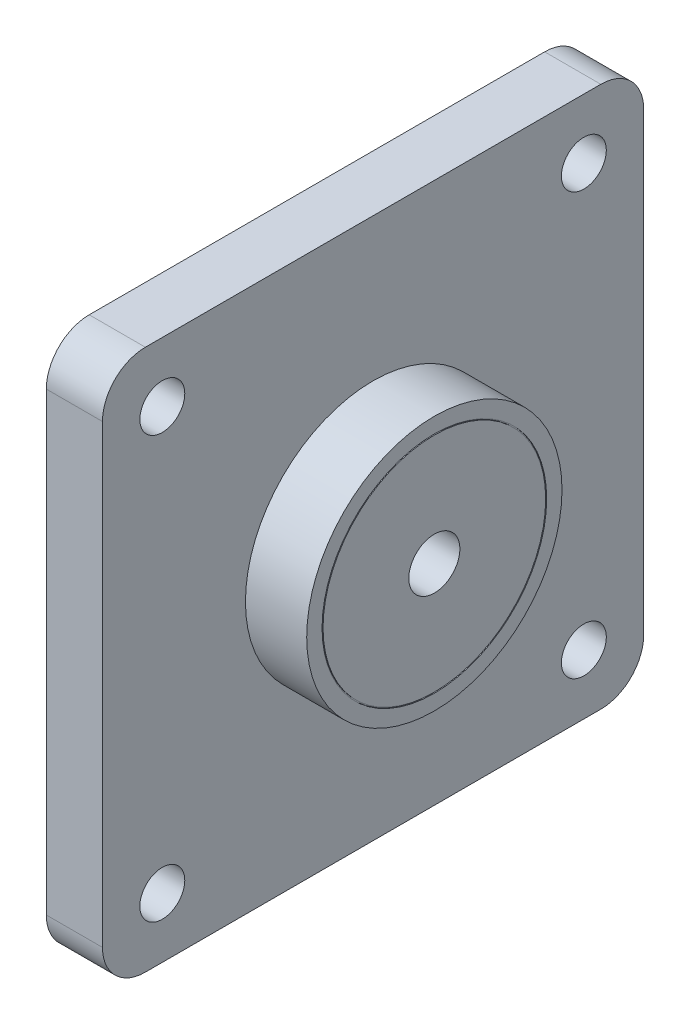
ISO-10303-21;
HEADER;
FILE_DESCRIPTION(('STEP AP214'),'2;1');
FILE_NAME('part.step','',(''),(''),'','','');
FILE_SCHEMA(('AUTOMOTIVE_DESIGN { 1 0 10303 214 1 1 1 1 }'));
ENDSEC;
DATA;
#1=APPLICATION_CONTEXT('core data for automotive mechanical design processes');
#2=APPLICATION_PROTOCOL_DEFINITION('international standard','automotive_design',2000,#1);
#3=PRODUCT_CONTEXT('',#1,'mechanical');
#4=PRODUCT('Part','Part','',(#3));
#5=PRODUCT_RELATED_PRODUCT_CATEGORY('part','',(#4));
#6=PRODUCT_DEFINITION_FORMATION('','',#4);
#7=PRODUCT_DEFINITION_CONTEXT('part definition',#1,'design');
#8=PRODUCT_DEFINITION('design','',#6,#7);
#9=PRODUCT_DEFINITION_SHAPE('','',#8);
#10=(LENGTH_UNIT() NAMED_UNIT(*) SI_UNIT(.MILLI.,.METRE.));
#11=(NAMED_UNIT(*) PLANE_ANGLE_UNIT() SI_UNIT($,.RADIAN.));
#12=(NAMED_UNIT(*) SI_UNIT($,.STERADIAN.) SOLID_ANGLE_UNIT());
#13=UNCERTAINTY_MEASURE_WITH_UNIT(LENGTH_MEASURE(1.E-05),#10,'distance_accuracy_value','');
#14=(GEOMETRIC_REPRESENTATION_CONTEXT(3) GLOBAL_UNCERTAINTY_ASSIGNED_CONTEXT((#13)) GLOBAL_UNIT_ASSIGNED_CONTEXT((#10,
#11,#12)) REPRESENTATION_CONTEXT('',''));
#15=CARTESIAN_POINT('',(0.,0.,0.));
#16=DIRECTION('',(0.,0.,1.));
#17=DIRECTION('',(1.,0.,0.));
#18=AXIS2_PLACEMENT_3D('',#15,#16,#17);
#19=CARTESIAN_POINT('',(0.,-33.655,33.655));
#20=DIRECTION('',(1.,0.,0.));
#21=DIRECTION('',(0.,0.,-1.));
#22=AXIS2_PLACEMENT_3D('',#19,#20,#21);
#23=PLANE('',#22);
#24=CARTESIAN_POINT('',(0.,26.2128,26.2128));
#25=DIRECTION('',(1.,0.,0.));
#26=DIRECTION('',(0.,0.,-1.));
#27=AXIS2_PLACEMENT_3D('',#24,#25,#26);
#28=CIRCLE('',#27,2.79400000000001);
#29=CARTESIAN_POINT('',(0.,26.2128,23.4188));
#30=VERTEX_POINT('',#29);
#31=EDGE_CURVE('E190',#30,#30,#28,.T.);
#32=ORIENTED_EDGE('',*,*,#31,.T.);
#33=EDGE_LOOP('',(#32));
#34=FACE_BOUND('',#33,.T.);
#35=CARTESIAN_POINT('',(0.,26.2128,-26.2128));
#36=DIRECTION('',(1.,0.,0.));
#37=DIRECTION('',(0.,0.,-1.));
#38=AXIS2_PLACEMENT_3D('',#35,#36,#37);
#39=CIRCLE('',#38,2.79400000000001);
#40=CARTESIAN_POINT('',(0.,26.2128,-29.0068));
#41=VERTEX_POINT('',#40);
#42=EDGE_CURVE('E184',#41,#41,#39,.T.);
#43=ORIENTED_EDGE('',*,*,#42,.T.);
#44=EDGE_LOOP('',(#43));
#45=FACE_BOUND('',#44,.T.);
#46=CARTESIAN_POINT('',(0.,-26.2128,-26.2128));
#47=DIRECTION('',(1.,0.,0.));
#48=DIRECTION('',(0.,0.,-1.));
#49=AXIS2_PLACEMENT_3D('',#46,#47,#48);
#50=CIRCLE('',#49,2.79400000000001);
#51=CARTESIAN_POINT('',(0.,-26.2128,-29.0068));
#52=VERTEX_POINT('',#51);
#53=EDGE_CURVE('E178',#52,#52,#50,.T.);
#54=ORIENTED_EDGE('',*,*,#53,.T.);
#55=EDGE_LOOP('',(#54));
#56=FACE_BOUND('',#55,.T.);
#57=CARTESIAN_POINT('',(0.,-26.2128,26.2128));
#58=DIRECTION('',(1.,0.,0.));
#59=DIRECTION('',(0.,0.,-1.));
#60=AXIS2_PLACEMENT_3D('',#57,#58,#59);
#61=CIRCLE('',#60,2.79400000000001);
#62=CARTESIAN_POINT('',(0.,-26.2128,23.4188));
#63=VERTEX_POINT('',#62);
#64=EDGE_CURVE('E172',#63,#63,#61,.T.);
#65=ORIENTED_EDGE('',*,*,#64,.T.);
#66=EDGE_LOOP('',(#65));
#67=FACE_BOUND('',#66,.T.);
#68=DIRECTION('',(0.,0.,1.));
#69=VECTOR('',#68,1.);
#70=CARTESIAN_POINT('',(0.,33.655,-33.655));
#71=LINE('',#70,#69);
#72=CARTESIAN_POINT('',(0.,33.655,-28.321));
#73=VERTEX_POINT('',#72);
#74=CARTESIAN_POINT('',(0.,33.655,28.321));
#75=VERTEX_POINT('',#74);
#76=EDGE_CURVE('E100',#73,#75,#71,.T.);
#77=ORIENTED_EDGE('',*,*,#76,.F.);
#78=CARTESIAN_POINT('',(0.,28.321,-28.321));
#79=DIRECTION('',(1.,0.,0.));
#80=DIRECTION('',(0.,0.,-1.));
#81=AXIS2_PLACEMENT_3D('',#78,#79,#80);
#82=CIRCLE('',#81,5.334);
#83=CARTESIAN_POINT('',(0.,28.321,-33.655));
#84=VERTEX_POINT('',#83);
#85=EDGE_CURVE('E83',#73,#84,#82,.F.);
#86=ORIENTED_EDGE('',*,*,#85,.T.);
#87=DIRECTION('',(0.,1.,0.));
#88=VECTOR('',#87,1.);
#89=CARTESIAN_POINT('',(0.,-33.655,-33.655));
#90=LINE('',#89,#88);
#91=CARTESIAN_POINT('',(0.,-28.321,-33.655));
#92=VERTEX_POINT('',#91);
#93=EDGE_CURVE('E110',#92,#84,#90,.T.);
#94=ORIENTED_EDGE('',*,*,#93,.F.);
#95=CARTESIAN_POINT('',(0.,-28.321,-28.321));
#96=DIRECTION('',(1.,0.,0.));
#97=DIRECTION('',(0.,0.,-1.));
#98=AXIS2_PLACEMENT_3D('',#95,#96,#97);
#99=CIRCLE('',#98,5.334);
#100=CARTESIAN_POINT('',(0.,-33.655,-28.321));
#101=VERTEX_POINT('',#100);
#102=EDGE_CURVE('E94',#92,#101,#99,.F.);
#103=ORIENTED_EDGE('',*,*,#102,.T.);
#104=DIRECTION('',(0.,0.,-1.));
#105=VECTOR('',#104,1.);
#106=CARTESIAN_POINT('',(0.,-33.655,33.655));
#107=LINE('',#106,#105);
#108=CARTESIAN_POINT('',(0.,-33.655,28.321));
#109=VERTEX_POINT('',#108);
#110=EDGE_CURVE('E114',#109,#101,#107,.T.);
#111=ORIENTED_EDGE('',*,*,#110,.F.);
#112=CARTESIAN_POINT('',(0.,-28.321,28.321));
#113=DIRECTION('',(1.,0.,0.));
#114=DIRECTION('',(0.,0.,-1.));
#115=AXIS2_PLACEMENT_3D('',#112,#113,#114);
#116=CIRCLE('',#115,5.334);
#117=CARTESIAN_POINT('',(0.,-28.321,33.655));
#118=VERTEX_POINT('',#117);
#119=EDGE_CURVE('E120',#109,#118,#116,.F.);
#120=ORIENTED_EDGE('',*,*,#119,.T.);
#121=DIRECTION('',(0.,-1.,0.));
#122=VECTOR('',#121,1.);
#123=CARTESIAN_POINT('',(0.,33.655,33.655));
#124=LINE('',#123,#122);
#125=CARTESIAN_POINT('',(0.,28.321,33.655));
#126=VERTEX_POINT('',#125);
#127=EDGE_CURVE('E142',#126,#118,#124,.T.);
#128=ORIENTED_EDGE('',*,*,#127,.F.);
#129=CARTESIAN_POINT('',(0.,28.321,28.321));
#130=DIRECTION('',(1.,0.,0.));
#131=DIRECTION('',(0.,0.,-1.));
#132=AXIS2_PLACEMENT_3D('',#129,#130,#131);
#133=CIRCLE('',#132,5.334);
#134=EDGE_CURVE('E104',#126,#75,#133,.F.);
#135=ORIENTED_EDGE('',*,*,#134,.T.);
#136=EDGE_LOOP('',(#77,#86,#94,#103,#111,#120,#128,#135));
#137=FACE_BOUND('',#136,.T.);
#138=CARTESIAN_POINT('',(0.,0.,0.));
#139=DIRECTION('',(1.,0.,0.));
#140=DIRECTION('',(0.,0.,-1.));
#141=AXIS2_PLACEMENT_3D('',#138,#139,#140);
#142=CIRCLE('',#141,3.175);
#143=CARTESIAN_POINT('',(0.,0.,-3.175));
#144=VERTEX_POINT('',#143);
#145=EDGE_CURVE('E197',#144,#144,#142,.T.);
#146=ORIENTED_EDGE('',*,*,#145,.T.);
#147=EDGE_LOOP('',(#146));
#148=FACE_BOUND('',#147,.T.);
#149=ADVANCED_FACE('F17',(#34,#45,#56,#67,#137,#148),#23,.F.);
#150=CARTESIAN_POINT('',(14.605,0.,0.));
#151=DIRECTION('',(1.,0.,0.));
#152=DIRECTION('',(0.,0.,-1.));
#153=AXIS2_PLACEMENT_3D('',#150,#151,#152);
#154=PLANE('',#153);
#155=CARTESIAN_POINT('',(14.605,0.,0.));
#156=DIRECTION('',(-1.,0.,0.));
#157=DIRECTION('',(0.,0.,1.));
#158=AXIS2_PLACEMENT_3D('',#155,#156,#157);
#159=CIRCLE('',#158,13.843);
#160=CARTESIAN_POINT('',(14.605,0.,13.843));
#161=VERTEX_POINT('',#160);
#162=EDGE_CURVE('E163',#161,#161,#159,.T.);
#163=ORIENTED_EDGE('',*,*,#162,.F.);
#164=EDGE_LOOP('',(#163));
#165=FACE_BOUND('',#164,.T.);
#166=CARTESIAN_POINT('',(14.605,0.,0.));
#167=DIRECTION('',(1.,0.,0.));
#168=DIRECTION('',(0.,0.,-1.));
#169=AXIS2_PLACEMENT_3D('',#166,#167,#168);
#170=CIRCLE('',#169,3.175);
#171=CARTESIAN_POINT('',(14.605,0.,-3.175));
#172=VERTEX_POINT('',#171);
#173=EDGE_CURVE('E196',#172,#172,#170,.T.);
#174=ORIENTED_EDGE('',*,*,#173,.F.);
#175=EDGE_LOOP('',(#174));
#176=FACE_BOUND('',#175,.T.);
#177=ADVANCED_FACE('F206',(#165,#176),#154,.T.);
#178=CARTESIAN_POINT('',(14.605,0.,0.));
#179=DIRECTION('',(1.,0.,0.));
#180=DIRECTION('',(0.,0.,-1.));
#181=AXIS2_PLACEMENT_3D('',#178,#179,#180);
#182=CIRCLE('',#181,15.875);
#183=CARTESIAN_POINT('',(14.605,0.,15.875));
#184=VERTEX_POINT('',#183);
#185=EDGE_CURVE('E147',#184,#184,#182,.T.);
#186=ORIENTED_EDGE('',*,*,#185,.T.);
#187=EDGE_LOOP('',(#186));
#188=FACE_BOUND('',#187,.T.);
#189=CARTESIAN_POINT('',(14.605,0.,0.));
#190=DIRECTION('',(-1.,0.,0.));
#191=DIRECTION('',(0.,0.,1.));
#192=AXIS2_PLACEMENT_3D('',#189,#190,#191);
#193=CIRCLE('',#192,13.97);
#194=CARTESIAN_POINT('',(14.605,0.,13.97));
#195=VERTEX_POINT('',#194);
#196=EDGE_CURVE('E166',#195,#195,#193,.T.);
#197=ORIENTED_EDGE('',*,*,#196,.T.);
#198=EDGE_LOOP('',(#197));
#199=FACE_BOUND('',#198,.T.);
#200=ADVANCED_FACE('F208',(#188,#199),#154,.T.);
#201=CARTESIAN_POINT('',(6.985,-33.655,33.655));
#202=DIRECTION('',(1.,0.,0.));
#203=DIRECTION('',(0.,0.,-1.));
#204=AXIS2_PLACEMENT_3D('',#201,#202,#203);
#205=PLANE('',#204);
#206=CARTESIAN_POINT('',(6.985,26.2128,26.2128));
#207=DIRECTION('',(1.,0.,0.));
#208=DIRECTION('',(0.,0.,-1.));
#209=AXIS2_PLACEMENT_3D('',#206,#207,#208);
#210=CIRCLE('',#209,2.79400000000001);
#211=CARTESIAN_POINT('',(6.985,26.2128,23.4188));
#212=VERTEX_POINT('',#211);
#213=EDGE_CURVE('E193',#212,#212,#210,.T.);
#214=ORIENTED_EDGE('',*,*,#213,.F.);
#215=EDGE_LOOP('',(#214));
#216=FACE_BOUND('',#215,.T.);
#217=CARTESIAN_POINT('',(6.985,26.2128,-26.2128));
#218=DIRECTION('',(1.,0.,0.));
#219=DIRECTION('',(0.,0.,-1.));
#220=AXIS2_PLACEMENT_3D('',#217,#218,#219);
#221=CIRCLE('',#220,2.79400000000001);
#222=CARTESIAN_POINT('',(6.985,26.2128,-29.0068));
#223=VERTEX_POINT('',#222);
#224=EDGE_CURVE('E187',#223,#223,#221,.T.);
#225=ORIENTED_EDGE('',*,*,#224,.F.);
#226=EDGE_LOOP('',(#225));
#227=FACE_BOUND('',#226,.T.);
#228=CARTESIAN_POINT('',(6.985,-26.2128,-26.2128));
#229=DIRECTION('',(1.,0.,0.));
#230=DIRECTION('',(0.,0.,-1.));
#231=AXIS2_PLACEMENT_3D('',#228,#229,#230);
#232=CIRCLE('',#231,2.79400000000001);
#233=CARTESIAN_POINT('',(6.985,-26.2128,-29.0068));
#234=VERTEX_POINT('',#233);
#235=EDGE_CURVE('E181',#234,#234,#232,.T.);
#236=ORIENTED_EDGE('',*,*,#235,.F.);
#237=EDGE_LOOP('',(#236));
#238=FACE_BOUND('',#237,.T.);
#239=CARTESIAN_POINT('',(6.985,-26.2128,26.2128));
#240=DIRECTION('',(1.,0.,0.));
#241=DIRECTION('',(0.,0.,-1.));
#242=AXIS2_PLACEMENT_3D('',#239,#240,#241);
#243=CIRCLE('',#242,2.79400000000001);
#244=CARTESIAN_POINT('',(6.985,-26.2128,23.4188));
#245=VERTEX_POINT('',#244);
#246=EDGE_CURVE('E175',#245,#245,#243,.T.);
#247=ORIENTED_EDGE('',*,*,#246,.F.);
#248=EDGE_LOOP('',(#247));
#249=FACE_BOUND('',#248,.T.);
#250=DIRECTION('',(0.,1.,0.));
#251=VECTOR('',#250,1.);
#252=CARTESIAN_POINT('',(6.985,-33.655,-33.655));
#253=LINE('',#252,#251);
#254=CARTESIAN_POINT('',(6.985,-28.321,-33.655));
#255=VERTEX_POINT('',#254);
#256=CARTESIAN_POINT('',(6.985,28.321,-33.655));
#257=VERTEX_POINT('',#256);
#258=EDGE_CURVE('E154',#255,#257,#253,.T.);
#259=ORIENTED_EDGE('',*,*,#258,.T.);
#260=CARTESIAN_POINT('',(6.985,28.321,-28.321));
#261=DIRECTION('',(1.,0.,0.));
#262=DIRECTION('',(0.,0.,-1.));
#263=AXIS2_PLACEMENT_3D('',#260,#261,#262);
#264=CIRCLE('',#263,5.334);
#265=CARTESIAN_POINT('',(6.985,33.655,-28.321));
#266=VERTEX_POINT('',#265);
#267=EDGE_CURVE('E131',#257,#266,#264,.T.);
#268=ORIENTED_EDGE('',*,*,#267,.T.);
#269=DIRECTION('',(0.,0.,1.));
#270=VECTOR('',#269,1.);
#271=CARTESIAN_POINT('',(6.985,33.655,-33.655));
#272=LINE('',#271,#270);
#273=CARTESIAN_POINT('',(6.985,33.655,28.321));
#274=VERTEX_POINT('',#273);
#275=EDGE_CURVE('E103',#266,#274,#272,.T.);
#276=ORIENTED_EDGE('',*,*,#275,.T.);
#277=CARTESIAN_POINT('',(6.985,28.321,28.321));
#278=DIRECTION('',(1.,0.,0.));
#279=DIRECTION('',(0.,0.,-1.));
#280=AXIS2_PLACEMENT_3D('',#277,#278,#279);
#281=CIRCLE('',#280,5.334);
#282=CARTESIAN_POINT('',(6.985,28.321,33.655));
#283=VERTEX_POINT('',#282);
#284=EDGE_CURVE('E126',#274,#283,#281,.T.);
#285=ORIENTED_EDGE('',*,*,#284,.T.);
#286=DIRECTION('',(0.,-1.,0.));
#287=VECTOR('',#286,1.);
#288=CARTESIAN_POINT('',(6.985,33.655,33.655));
#289=LINE('',#288,#287);
#290=CARTESIAN_POINT('',(6.985,-28.321,33.655));
#291=VERTEX_POINT('',#290);
#292=EDGE_CURVE('E109',#283,#291,#289,.T.);
#293=ORIENTED_EDGE('',*,*,#292,.T.);
#294=CARTESIAN_POINT('',(6.985,-28.321,28.321));
#295=DIRECTION('',(1.,0.,0.));
#296=DIRECTION('',(0.,0.,-1.));
#297=AXIS2_PLACEMENT_3D('',#294,#295,#296);
#298=CIRCLE('',#297,5.334);
#299=CARTESIAN_POINT('',(6.985,-33.655,28.321));
#300=VERTEX_POINT('',#299);
#301=EDGE_CURVE('E39',#291,#300,#298,.T.);
#302=ORIENTED_EDGE('',*,*,#301,.T.);
#303=DIRECTION('',(0.,0.,-1.));
#304=VECTOR('',#303,1.);
#305=CARTESIAN_POINT('',(6.985,-33.655,33.655));
#306=LINE('',#305,#304);
#307=CARTESIAN_POINT('',(6.985,-33.655,-28.321));
#308=VERTEX_POINT('',#307);
#309=EDGE_CURVE('E112',#300,#308,#306,.T.);
#310=ORIENTED_EDGE('',*,*,#309,.T.);
#311=CARTESIAN_POINT('',(6.985,-28.321,-28.321));
#312=DIRECTION('',(1.,0.,0.));
#313=DIRECTION('',(0.,0.,-1.));
#314=AXIS2_PLACEMENT_3D('',#311,#312,#313);
#315=CIRCLE('',#314,5.334);
#316=EDGE_CURVE('E129',#308,#255,#315,.T.);
#317=ORIENTED_EDGE('',*,*,#316,.T.);
#318=EDGE_LOOP('',(#259,#268,#276,#285,#293,#302,#310,#317));
#319=FACE_BOUND('',#318,.T.);
#320=CARTESIAN_POINT('',(6.985,0.,0.));
#321=DIRECTION('',(1.,0.,0.));
#322=DIRECTION('',(0.,0.,-1.));
#323=AXIS2_PLACEMENT_3D('',#320,#321,#322);
#324=CIRCLE('',#323,15.875);
#325=CARTESIAN_POINT('',(6.985,0.,15.875));
#326=VERTEX_POINT('',#325);
#327=EDGE_CURVE('E150',#326,#326,#324,.T.);
#328=ORIENTED_EDGE('',*,*,#327,.F.);
#329=EDGE_LOOP('',(#328));
#330=FACE_BOUND('',#329,.T.);
#331=ADVANCED_FACE('F216',(#216,#227,#238,#249,#319,#330),#205,.T.);
#332=CARTESIAN_POINT('',(6.985,33.655,33.655));
#333=DIRECTION('',(0.,0.,-1.));
#334=DIRECTION('',(0.,1.,0.));
#335=AXIS2_PLACEMENT_3D('',#332,#333,#334);
#336=PLANE('',#335);
#337=ORIENTED_EDGE('',*,*,#127,.T.);
#338=DIRECTION('',(-1.,0.,0.));
#339=VECTOR('',#338,1.);
#340=CARTESIAN_POINT('',(6.985,-28.321,33.655));
#341=LINE('',#340,#339);
#342=EDGE_CURVE('E11',#118,#291,#341,.F.);
#343=ORIENTED_EDGE('',*,*,#342,.T.);
#344=ORIENTED_EDGE('',*,*,#292,.F.);
#345=DIRECTION('',(-1.,0.,0.));
#346=VECTOR('',#345,1.);
#347=CARTESIAN_POINT('',(6.985,28.321,33.655));
#348=LINE('',#347,#346);
#349=EDGE_CURVE('E25',#283,#126,#348,.T.);
#350=ORIENTED_EDGE('',*,*,#349,.T.);
#351=EDGE_LOOP('',(#337,#343,#344,#350));
#352=FACE_BOUND('',#351,.T.);
#353=ADVANCED_FACE('F141',(#352),#336,.F.);
#354=CARTESIAN_POINT('',(6.985,-33.655,33.655));
#355=DIRECTION('',(0.,1.,0.));
#356=DIRECTION('',(0.,0.,1.));
#357=AXIS2_PLACEMENT_3D('',#354,#355,#356);
#358=PLANE('',#357);
#359=ORIENTED_EDGE('',*,*,#110,.T.);
#360=DIRECTION('',(-1.,0.,0.));
#361=VECTOR('',#360,1.);
#362=CARTESIAN_POINT('',(6.985,-33.655,-28.321));
#363=LINE('',#362,#361);
#364=EDGE_CURVE('E32',#101,#308,#363,.F.);
#365=ORIENTED_EDGE('',*,*,#364,.T.);
#366=ORIENTED_EDGE('',*,*,#309,.F.);
#367=DIRECTION('',(-1.,0.,0.));
#368=VECTOR('',#367,1.);
#369=CARTESIAN_POINT('',(6.985,-33.655,28.321));
#370=LINE('',#369,#368);
#371=EDGE_CURVE('E133',#300,#109,#370,.T.);
#372=ORIENTED_EDGE('',*,*,#371,.T.);
#373=EDGE_LOOP('',(#359,#365,#366,#372));
#374=FACE_BOUND('',#373,.T.);
#375=ADVANCED_FACE('F237',(#374),#358,.F.);
#376=CARTESIAN_POINT('',(6.985,-33.655,-33.655));
#377=DIRECTION('',(0.,0.,1.));
#378=DIRECTION('',(0.,-1.,0.));
#379=AXIS2_PLACEMENT_3D('',#376,#377,#378);
#380=PLANE('',#379);
#381=ORIENTED_EDGE('',*,*,#93,.T.);
#382=DIRECTION('',(-1.,0.,0.));
#383=VECTOR('',#382,1.);
#384=CARTESIAN_POINT('',(6.985,28.321,-33.655));
#385=LINE('',#384,#383);
#386=EDGE_CURVE('E88',#84,#257,#385,.F.);
#387=ORIENTED_EDGE('',*,*,#386,.T.);
#388=ORIENTED_EDGE('',*,*,#258,.F.);
#389=DIRECTION('',(-1.,0.,0.));
#390=VECTOR('',#389,1.);
#391=CARTESIAN_POINT('',(6.985,-28.321,-33.655));
#392=LINE('',#391,#390);
#393=EDGE_CURVE('E93',#255,#92,#392,.T.);
#394=ORIENTED_EDGE('',*,*,#393,.T.);
#395=EDGE_LOOP('',(#381,#387,#388,#394));
#396=FACE_BOUND('',#395,.T.);
#397=ADVANCED_FACE('F234',(#396),#380,.F.);
#398=CARTESIAN_POINT('',(6.985,33.655,-33.655));
#399=DIRECTION('',(0.,-1.,0.));
#400=DIRECTION('',(0.,0.,-1.));
#401=AXIS2_PLACEMENT_3D('',#398,#399,#400);
#402=PLANE('',#401);
#403=ORIENTED_EDGE('',*,*,#275,.F.);
#404=DIRECTION('',(-1.,0.,0.));
#405=VECTOR('',#404,1.);
#406=CARTESIAN_POINT('',(6.985,33.655,-28.321));
#407=LINE('',#406,#405);
#408=EDGE_CURVE('E87',#266,#73,#407,.T.);
#409=ORIENTED_EDGE('',*,*,#408,.T.);
#410=ORIENTED_EDGE('',*,*,#76,.T.);
#411=DIRECTION('',(-1.,0.,0.));
#412=VECTOR('',#411,1.);
#413=CARTESIAN_POINT('',(6.985,33.655,28.321));
#414=LINE('',#413,#412);
#415=EDGE_CURVE('E105',#75,#274,#414,.F.);
#416=ORIENTED_EDGE('',*,*,#415,.T.);
#417=EDGE_LOOP('',(#403,#409,#410,#416));
#418=FACE_BOUND('',#417,.T.);
#419=ADVANCED_FACE('F99',(#418),#402,.F.);
#420=CARTESIAN_POINT('',(6.985,28.321,-28.321));
#421=DIRECTION('',(-1.,0.,0.));
#422=DIRECTION('',(0.,0.,1.));
#423=AXIS2_PLACEMENT_3D('',#420,#421,#422);
#424=CYLINDRICAL_SURFACE('',#423,5.334);
#425=ORIENTED_EDGE('',*,*,#267,.F.);
#426=ORIENTED_EDGE('',*,*,#386,.F.);
#427=ORIENTED_EDGE('',*,*,#85,.F.);
#428=ORIENTED_EDGE('',*,*,#408,.F.);
#429=EDGE_LOOP('',(#425,#426,#427,#428));
#430=FACE_BOUND('',#429,.T.);
#431=ADVANCED_FACE('F86',(#430),#424,.T.);
#432=CARTESIAN_POINT('',(6.985,-28.321,-28.321));
#433=DIRECTION('',(-1.,0.,0.));
#434=DIRECTION('',(0.,0.,1.));
#435=AXIS2_PLACEMENT_3D('',#432,#433,#434);
#436=CYLINDRICAL_SURFACE('',#435,5.334);
#437=ORIENTED_EDGE('',*,*,#316,.F.);
#438=ORIENTED_EDGE('',*,*,#364,.F.);
#439=ORIENTED_EDGE('',*,*,#102,.F.);
#440=ORIENTED_EDGE('',*,*,#393,.F.);
#441=EDGE_LOOP('',(#437,#438,#439,#440));
#442=FACE_BOUND('',#441,.T.);
#443=ADVANCED_FACE('F245',(#442),#436,.T.);
#444=CARTESIAN_POINT('',(6.985,-28.321,28.321));
#445=DIRECTION('',(-1.,0.,0.));
#446=DIRECTION('',(0.,0.,1.));
#447=AXIS2_PLACEMENT_3D('',#444,#445,#446);
#448=CYLINDRICAL_SURFACE('',#447,5.334);
#449=ORIENTED_EDGE('',*,*,#301,.F.);
#450=ORIENTED_EDGE('',*,*,#342,.F.);
#451=ORIENTED_EDGE('',*,*,#119,.F.);
#452=ORIENTED_EDGE('',*,*,#371,.F.);
#453=EDGE_LOOP('',(#449,#450,#451,#452));
#454=FACE_BOUND('',#453,.T.);
#455=ADVANCED_FACE('F247',(#454),#448,.T.);
#456=CARTESIAN_POINT('',(6.985,28.321,28.321));
#457=DIRECTION('',(-1.,0.,0.));
#458=DIRECTION('',(0.,0.,1.));
#459=AXIS2_PLACEMENT_3D('',#456,#457,#458);
#460=CYLINDRICAL_SURFACE('',#459,5.334);
#461=ORIENTED_EDGE('',*,*,#284,.F.);
#462=ORIENTED_EDGE('',*,*,#415,.F.);
#463=ORIENTED_EDGE('',*,*,#134,.F.);
#464=ORIENTED_EDGE('',*,*,#349,.F.);
#465=EDGE_LOOP('',(#461,#462,#463,#464));
#466=FACE_BOUND('',#465,.T.);
#467=ADVANCED_FACE('F19',(#466),#460,.T.);
#468=CARTESIAN_POINT('',(14.605,0.,0.));
#469=DIRECTION('',(-1.,0.,0.));
#470=DIRECTION('',(0.,0.,1.));
#471=AXIS2_PLACEMENT_3D('',#468,#469,#470);
#472=CYLINDRICAL_SURFACE('',#471,15.875);
#473=CARTESIAN_POINT('',(14.605,0.,15.875));
#474=CARTESIAN_POINT('',(14.525625,0.,15.875));
#475=CARTESIAN_POINT('',(14.44625,0.,15.875));
#476=CARTESIAN_POINT('',(14.2875,0.,15.875));
#477=CARTESIAN_POINT('',(14.208125,0.,15.875));
#478=CARTESIAN_POINT('',(14.049375,0.,15.875));
#479=CARTESIAN_POINT('',(13.97,0.,15.875));
#480=CARTESIAN_POINT('',(13.81125,0.,15.875));
#481=CARTESIAN_POINT('',(13.731875,0.,15.875));
#482=CARTESIAN_POINT('',(13.573125,0.,15.875));
#483=CARTESIAN_POINT('',(13.49375,0.,15.875));
#484=CARTESIAN_POINT('',(13.335,0.,15.875));
#485=CARTESIAN_POINT('',(13.255625,0.,15.875));
#486=CARTESIAN_POINT('',(13.096875,0.,15.875));
#487=CARTESIAN_POINT('',(13.0175,0.,15.875));
#488=CARTESIAN_POINT('',(12.85875,0.,15.875));
#489=CARTESIAN_POINT('',(12.779375,0.,15.875));
#490=CARTESIAN_POINT('',(12.620625,0.,15.875));
#491=CARTESIAN_POINT('',(12.54125,0.,15.875));
#492=CARTESIAN_POINT('',(12.3825,0.,15.875));
#493=CARTESIAN_POINT('',(12.303125,0.,15.875));
#494=CARTESIAN_POINT('',(12.144375,0.,15.875));
#495=CARTESIAN_POINT('',(12.065,0.,15.875));
#496=CARTESIAN_POINT('',(11.90625,0.,15.875));
#497=CARTESIAN_POINT('',(11.826875,0.,15.875));
#498=CARTESIAN_POINT('',(11.668125,0.,15.875));
#499=CARTESIAN_POINT('',(11.58875,0.,15.875));
#500=CARTESIAN_POINT('',(11.43,0.,15.875));
#501=CARTESIAN_POINT('',(11.350625,0.,15.875));
#502=CARTESIAN_POINT('',(11.191875,0.,15.875));
#503=CARTESIAN_POINT('',(11.1125,0.,15.875));
#504=CARTESIAN_POINT('',(10.95375,0.,15.875));
#505=CARTESIAN_POINT('',(10.874375,0.,15.875));
#506=CARTESIAN_POINT('',(10.715625,0.,15.875));
#507=CARTESIAN_POINT('',(10.63625,0.,15.875));
#508=CARTESIAN_POINT('',(10.4775,0.,15.875));
#509=CARTESIAN_POINT('',(10.398125,0.,15.875));
#510=CARTESIAN_POINT('',(10.239375,0.,15.875));
#511=CARTESIAN_POINT('',(10.16,0.,15.875));
#512=CARTESIAN_POINT('',(10.00125,0.,15.875));
#513=CARTESIAN_POINT('',(9.921875,0.,15.875));
#514=CARTESIAN_POINT('',(9.763125,0.,15.875));
#515=CARTESIAN_POINT('',(9.68375,0.,15.875));
#516=CARTESIAN_POINT('',(9.525,0.,15.875));
#517=CARTESIAN_POINT('',(9.445625,0.,15.875));
#518=CARTESIAN_POINT('',(9.286875,0.,15.875));
#519=CARTESIAN_POINT('',(9.2075,0.,15.875));
#520=CARTESIAN_POINT('',(9.04875,0.,15.875));
#521=CARTESIAN_POINT('',(8.969375,0.,15.875));
#522=CARTESIAN_POINT('',(8.810625,0.,15.875));
#523=CARTESIAN_POINT('',(8.73125,0.,15.875));
#524=CARTESIAN_POINT('',(8.5725,0.,15.875));
#525=CARTESIAN_POINT('',(8.493125,0.,15.875));
#526=CARTESIAN_POINT('',(8.334375,0.,15.875));
#527=CARTESIAN_POINT('',(8.255,0.,15.875));
#528=CARTESIAN_POINT('',(8.09625,0.,15.875));
#529=CARTESIAN_POINT('',(8.016875,0.,15.875));
#530=CARTESIAN_POINT('',(7.858125,0.,15.875));
#531=CARTESIAN_POINT('',(7.77875,0.,15.875));
#532=CARTESIAN_POINT('',(7.62,0.,15.875));
#533=CARTESIAN_POINT('',(7.540625,0.,15.875));
#534=CARTESIAN_POINT('',(7.381875,0.,15.875));
#535=CARTESIAN_POINT('',(7.3025,0.,15.875));
#536=CARTESIAN_POINT('',(7.14375,0.,15.875));
#537=CARTESIAN_POINT('',(7.064375,0.,15.875));
#538=CARTESIAN_POINT('',(6.985,0.,15.875));
#539=B_SPLINE_CURVE_WITH_KNOTS('',3,(#473,#474,#475,#476,#477,#478,#479,#480,#481,#482,#483,
#484,#485,#486,#487,#488,#489,#490,#491,#492,#493,#494,#495,#496,#497,#498,#499,#500,#501,#502,
#503,#504,#505,#506,#507,#508,#509,#510,#511,#512,#513,#514,#515,#516,#517,#518,#519,#520,#521,
#522,#523,#524,#525,#526,#527,#528,#529,#530,#531,#532,#533,#534,#535,#536,#537,#538),
.UNSPECIFIED.,.F.,.F.,(4,2,2,2,2,2,2,2,2,2,2,2,2,2,2,2,2,2,2,2,2,2,2,2,2,2,2,2,2,2,2,2,4),(0.,
0.238125,0.476250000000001,0.714375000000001,0.9525,1.190625,1.42875,1.666875,1.905,2.143125,
2.38125,2.619375,2.8575,3.095625,3.33375,3.571875,3.81,4.048125,4.28625,4.524375,4.7625,
5.000625,5.23875,5.476875,5.715,5.953125,6.19125,6.429375,6.6675,6.905625,7.14375,7.381875,
7.62),.UNSPECIFIED.);
#540=EDGE_CURVE('BSEAM225',#184,#326,#539,.T.);
#541=ORIENTED_EDGE('',*,*,#185,.F.);
#542=ORIENTED_EDGE('',*,*,#327,.T.);
#543=ORIENTED_EDGE('',*,*,#540,.T.);
#544=ORIENTED_EDGE('',*,*,#540,.F.);
#545=EDGE_LOOP('',(#541,#543,#542,#544));
#546=FACE_BOUND('',#545,.T.);
#547=ADVANCED_FACE('F225',(#546),#472,.T.);
#548=CARTESIAN_POINT('',(14.478,13.97,0.));
#549=DIRECTION('',(1.,0.,0.));
#550=DIRECTION('',(0.,0.,-1.));
#551=AXIS2_PLACEMENT_3D('',#548,#549,#550);
#552=PLANE('',#551);
#553=CARTESIAN_POINT('',(14.478,0.,0.));
#554=DIRECTION('',(-1.,0.,0.));
#555=DIRECTION('',(0.,0.,1.));
#556=AXIS2_PLACEMENT_3D('',#553,#554,#555);
#557=CIRCLE('',#556,13.843);
#558=CARTESIAN_POINT('',(14.478,0.,13.843));
#559=VERTEX_POINT('',#558);
#560=EDGE_CURVE('E159',#559,#559,#557,.T.);
#561=ORIENTED_EDGE('',*,*,#560,.T.);
#562=EDGE_LOOP('',(#561));
#563=FACE_BOUND('',#562,.T.);
#564=CARTESIAN_POINT('',(14.478,0.,0.));
#565=DIRECTION('',(-1.,0.,0.));
#566=DIRECTION('',(0.,0.,1.));
#567=AXIS2_PLACEMENT_3D('',#564,#565,#566);
#568=CIRCLE('',#567,13.97);
#569=CARTESIAN_POINT('',(14.478,0.,13.97));
#570=VERTEX_POINT('',#569);
#571=EDGE_CURVE('E169',#570,#570,#568,.T.);
#572=ORIENTED_EDGE('',*,*,#571,.F.);
#573=EDGE_LOOP('',(#572));
#574=FACE_BOUND('',#573,.T.);
#575=ADVANCED_FACE('F223',(#563,#574),#552,.T.);
#576=CARTESIAN_POINT('',(0.,0.,0.));
#577=DIRECTION('',(-1.,0.,0.));
#578=DIRECTION('',(0.,0.,1.));
#579=AXIS2_PLACEMENT_3D('',#576,#577,#578);
#580=CYLINDRICAL_SURFACE('',#579,13.843);
#581=ORIENTED_EDGE('',*,*,#162,.T.);
#582=EDGE_LOOP('',(#581));
#583=FACE_BOUND('',#582,.T.);
#584=ORIENTED_EDGE('',*,*,#560,.F.);
#585=EDGE_LOOP('',(#584));
#586=FACE_BOUND('',#585,.T.);
#587=ADVANCED_FACE('F277',(#583,#586),#580,.T.);
#588=CARTESIAN_POINT('',(0.,0.,0.));
#589=DIRECTION('',(-1.,0.,0.));
#590=DIRECTION('',(0.,0.,1.));
#591=AXIS2_PLACEMENT_3D('',#588,#589,#590);
#592=CYLINDRICAL_SURFACE('',#591,13.97);
#593=ORIENTED_EDGE('',*,*,#571,.T.);
#594=EDGE_LOOP('',(#593));
#595=FACE_BOUND('',#594,.T.);
#596=ORIENTED_EDGE('',*,*,#196,.F.);
#597=EDGE_LOOP('',(#596));
#598=FACE_BOUND('',#597,.T.);
#599=ADVANCED_FACE('F285',(#595,#598),#592,.F.);
#600=CARTESIAN_POINT('',(6.985,-26.2128,26.2128));
#601=DIRECTION('',(1.,0.,0.));
#602=DIRECTION('',(0.,0.,-1.));
#603=AXIS2_PLACEMENT_3D('',#600,#601,#602);
#604=CYLINDRICAL_SURFACE('',#603,2.79400000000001);
#605=ORIENTED_EDGE('',*,*,#64,.F.);
#606=EDGE_LOOP('',(#605));
#607=FACE_BOUND('',#606,.T.);
#608=ORIENTED_EDGE('',*,*,#246,.T.);
#609=EDGE_LOOP('',(#608));
#610=FACE_BOUND('',#609,.T.);
#611=ADVANCED_FACE('F293',(#607,#610),#604,.F.);
#612=CARTESIAN_POINT('',(6.985,-26.2128,-26.2128));
#613=DIRECTION('',(1.,0.,0.));
#614=DIRECTION('',(0.,0.,-1.));
#615=AXIS2_PLACEMENT_3D('',#612,#613,#614);
#616=CYLINDRICAL_SURFACE('',#615,2.79400000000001);
#617=ORIENTED_EDGE('',*,*,#53,.F.);
#618=EDGE_LOOP('',(#617));
#619=FACE_BOUND('',#618,.T.);
#620=ORIENTED_EDGE('',*,*,#235,.T.);
#621=EDGE_LOOP('',(#620));
#622=FACE_BOUND('',#621,.T.);
#623=ADVANCED_FACE('F302',(#619,#622),#616,.F.);
#624=CARTESIAN_POINT('',(6.985,26.2128,-26.2128));
#625=DIRECTION('',(1.,0.,0.));
#626=DIRECTION('',(0.,0.,-1.));
#627=AXIS2_PLACEMENT_3D('',#624,#625,#626);
#628=CYLINDRICAL_SURFACE('',#627,2.79400000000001);
#629=ORIENTED_EDGE('',*,*,#42,.F.);
#630=EDGE_LOOP('',(#629));
#631=FACE_BOUND('',#630,.T.);
#632=ORIENTED_EDGE('',*,*,#224,.T.);
#633=EDGE_LOOP('',(#632));
#634=FACE_BOUND('',#633,.T.);
#635=ADVANCED_FACE('F311',(#631,#634),#628,.F.);
#636=CARTESIAN_POINT('',(6.985,26.2128,26.2128));
#637=DIRECTION('',(1.,0.,0.));
#638=DIRECTION('',(0.,0.,-1.));
#639=AXIS2_PLACEMENT_3D('',#636,#637,#638);
#640=CYLINDRICAL_SURFACE('',#639,2.79400000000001);
#641=ORIENTED_EDGE('',*,*,#31,.F.);
#642=EDGE_LOOP('',(#641));
#643=FACE_BOUND('',#642,.T.);
#644=ORIENTED_EDGE('',*,*,#213,.T.);
#645=EDGE_LOOP('',(#644));
#646=FACE_BOUND('',#645,.T.);
#647=ADVANCED_FACE('F320',(#643,#646),#640,.F.);
#648=CARTESIAN_POINT('',(14.605,0.,0.));
#649=DIRECTION('',(-1.,0.,0.));
#650=DIRECTION('',(0.,0.,1.));
#651=AXIS2_PLACEMENT_3D('',#648,#649,#650);
#652=CYLINDRICAL_SURFACE('',#651,3.175);
#653=ORIENTED_EDGE('',*,*,#173,.T.);
#654=EDGE_LOOP('',(#653));
#655=FACE_BOUND('',#654,.T.);
#656=ORIENTED_EDGE('',*,*,#145,.F.);
#657=EDGE_LOOP('',(#656));
#658=FACE_BOUND('',#657,.T.);
#659=ADVANCED_FACE('F203',(#655,#658),#652,.F.);
#660=CLOSED_SHELL('',(#149,#177,#200,#331,#353,#375,#397,#419,#431,#443,#455,#467,#547,#575,
#587,#599,#611,#623,#635,#647,#659));
#661=MANIFOLD_SOLID_BREP('B1',#660);
#662=ADVANCED_BREP_SHAPE_REPRESENTATION('',(#18,#661),#14);
#663=SHAPE_DEFINITION_REPRESENTATION(#9,#662);
ENDSEC;
END-ISO-10303-21;
